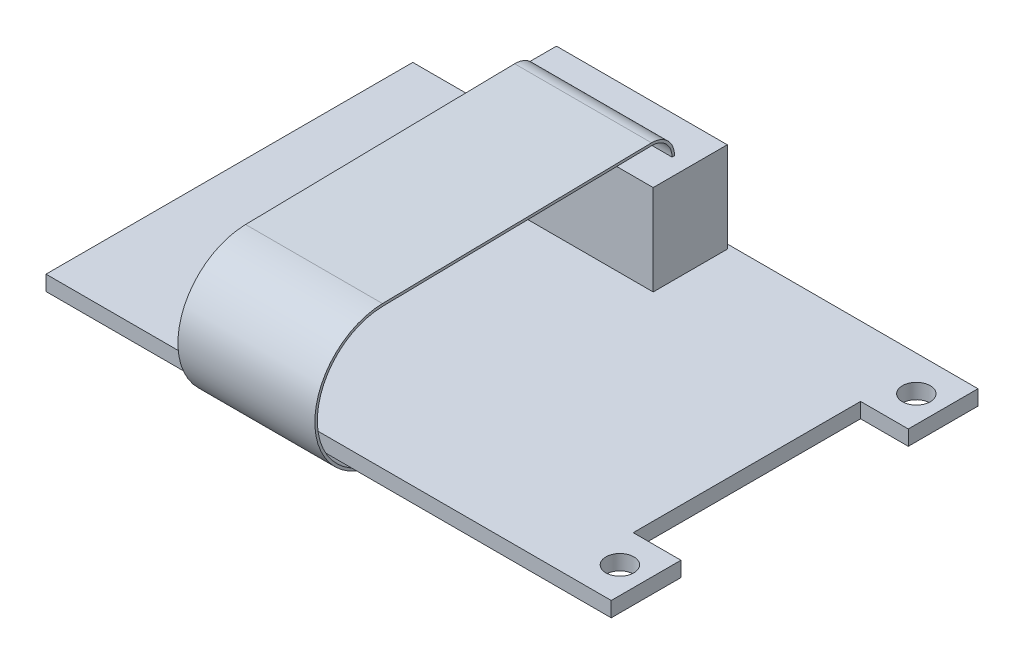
ISO-10303-21;
HEADER;
FILE_DESCRIPTION(('STEP AP214'),'2;1');
FILE_NAME('part.step','',(''),(''),'','','');
FILE_SCHEMA(('AUTOMOTIVE_DESIGN { 1 0 10303 214 1 1 1 1 }'));
ENDSEC;
DATA;
#1=APPLICATION_CONTEXT('core data for automotive mechanical design processes');
#2=APPLICATION_PROTOCOL_DEFINITION('international standard','automotive_design',2000,#1);
#3=PRODUCT_CONTEXT('',#1,'mechanical');
#4=PRODUCT('Part','Part','',(#3));
#5=PRODUCT_RELATED_PRODUCT_CATEGORY('part','',(#4));
#6=PRODUCT_DEFINITION_FORMATION('','',#4);
#7=PRODUCT_DEFINITION_CONTEXT('part definition',#1,'design');
#8=PRODUCT_DEFINITION('design','',#6,#7);
#9=PRODUCT_DEFINITION_SHAPE('','',#8);
#10=(LENGTH_UNIT() NAMED_UNIT(*) SI_UNIT(.MILLI.,.METRE.));
#11=(NAMED_UNIT(*) PLANE_ANGLE_UNIT() SI_UNIT($,.RADIAN.));
#12=(NAMED_UNIT(*) SI_UNIT($,.STERADIAN.) SOLID_ANGLE_UNIT());
#13=UNCERTAINTY_MEASURE_WITH_UNIT(LENGTH_MEASURE(1.E-05),#10,'distance_accuracy_value','');
#14=(GEOMETRIC_REPRESENTATION_CONTEXT(3) GLOBAL_UNCERTAINTY_ASSIGNED_CONTEXT((#13)) GLOBAL_UNIT_ASSIGNED_CONTEXT((#10,
#11,#12)) REPRESENTATION_CONTEXT('',''));
#15=CARTESIAN_POINT('',(0.,0.,0.));
#16=DIRECTION('',(0.,0.,1.));
#17=DIRECTION('',(1.,0.,0.));
#18=AXIS2_PLACEMENT_3D('',#15,#16,#17);
#19=CARTESIAN_POINT('',(-57.15,1.52399999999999,18.542));
#20=DIRECTION('',(0.,1.,0.));
#21=DIRECTION('',(0.,0.,1.));
#22=AXIS2_PLACEMENT_3D('',#19,#20,#21);
#23=PLANE('',#22);
#24=CARTESIAN_POINT('',(-2.6797,1.524,14.986));
#25=DIRECTION('',(0.,1.,0.));
#26=DIRECTION('',(0.,0.,1.));
#27=AXIS2_PLACEMENT_3D('',#24,#25,#26);
#28=CIRCLE('',#27,1.4097);
#29=CARTESIAN_POINT('',(-2.6797,1.524,13.5763));
#30=VERTEX_POINT('',#29);
#31=EDGE_CURVE('E308',#30,#30,#28,.T.);
#32=ORIENTED_EDGE('',*,*,#31,.F.);
#33=EDGE_LOOP('',(#32));
#34=FACE_BOUND('',#33,.T.);
#35=DIRECTION('',(0.,0.,1.));
#36=VECTOR('',#35,1.);
#37=CARTESIAN_POINT('',(-57.15,1.52399999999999,-18.542));
#38=LINE('',#37,#36);
#39=CARTESIAN_POINT('',(-57.15,1.52399999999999,-18.542));
#40=VERTEX_POINT('',#39);
#41=CARTESIAN_POINT('',(-57.15,1.52399999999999,18.542));
#42=VERTEX_POINT('',#41);
#43=EDGE_CURVE('E320',#40,#42,#38,.T.);
#44=ORIENTED_EDGE('',*,*,#43,.T.);
#45=DIRECTION('',(1.,0.,0.));
#46=VECTOR('',#45,1.);
#47=CARTESIAN_POINT('',(-57.15,1.52399999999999,18.542));
#48=LINE('',#47,#46);
#49=CARTESIAN_POINT('',(0.,1.524,18.542));
#50=VERTEX_POINT('',#49);
#51=EDGE_CURVE('E323',#42,#50,#48,.T.);
#52=ORIENTED_EDGE('',*,*,#51,.T.);
#53=DIRECTION('',(0.,0.,-1.));
#54=VECTOR('',#53,1.);
#55=CARTESIAN_POINT('',(0.,1.524,11.4935));
#56=LINE('',#55,#54);
#57=CARTESIAN_POINT('',(0.,1.524,11.4935));
#58=VERTEX_POINT('',#57);
#59=EDGE_CURVE('E326',#50,#58,#56,.T.);
#60=ORIENTED_EDGE('',*,*,#59,.T.);
#61=DIRECTION('',(-1.,0.,0.));
#62=VECTOR('',#61,1.);
#63=CARTESIAN_POINT('',(0.,1.524,11.4935));
#64=LINE('',#63,#62);
#65=CARTESIAN_POINT('',(-4.826,1.524,11.4935));
#66=VERTEX_POINT('',#65);
#67=EDGE_CURVE('E328',#58,#66,#64,.T.);
#68=ORIENTED_EDGE('',*,*,#67,.T.);
#69=DIRECTION('',(0.,0.,-1.));
#70=VECTOR('',#69,1.);
#71=CARTESIAN_POINT('',(-4.826,1.524,-11.4935));
#72=LINE('',#71,#70);
#73=CARTESIAN_POINT('',(-4.826,1.524,-11.4935));
#74=VERTEX_POINT('',#73);
#75=EDGE_CURVE('E330',#66,#74,#72,.T.);
#76=ORIENTED_EDGE('',*,*,#75,.T.);
#77=DIRECTION('',(1.,0.,0.));
#78=VECTOR('',#77,1.);
#79=CARTESIAN_POINT('',(0.,1.524,-11.4935));
#80=LINE('',#79,#78);
#81=CARTESIAN_POINT('',(0.,1.524,-11.4935));
#82=VERTEX_POINT('',#81);
#83=EDGE_CURVE('E332',#74,#82,#80,.T.);
#84=ORIENTED_EDGE('',*,*,#83,.T.);
#85=DIRECTION('',(0.,0.,-1.));
#86=VECTOR('',#85,1.);
#87=CARTESIAN_POINT('',(0.,1.524,-18.542));
#88=LINE('',#87,#86);
#89=CARTESIAN_POINT('',(0.,1.524,-18.542));
#90=VERTEX_POINT('',#89);
#91=EDGE_CURVE('E334',#82,#90,#88,.T.);
#92=ORIENTED_EDGE('',*,*,#91,.T.);
#93=DIRECTION('',(-1.,0.,0.));
#94=VECTOR('',#93,1.);
#95=CARTESIAN_POINT('',(-57.15,1.52399999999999,-18.542));
#96=LINE('',#95,#94);
#97=EDGE_CURVE('E336',#90,#40,#96,.T.);
#98=ORIENTED_EDGE('',*,*,#97,.T.);
#99=EDGE_LOOP('',(#44,#52,#60,#68,#76,#84,#92,#98));
#100=FACE_BOUND('',#99,.T.);
#101=CARTESIAN_POINT('',(-2.6797,1.524,-14.986));
#102=DIRECTION('',(0.,1.,0.));
#103=DIRECTION('',(0.,0.,1.));
#104=AXIS2_PLACEMENT_3D('',#101,#102,#103);
#105=CIRCLE('',#104,1.4097);
#106=CARTESIAN_POINT('',(-2.6797,1.524,-16.3957));
#107=VERTEX_POINT('',#106);
#108=EDGE_CURVE('E314',#107,#107,#105,.T.);
#109=ORIENTED_EDGE('',*,*,#108,.F.);
#110=EDGE_LOOP('',(#109));
#111=FACE_BOUND('',#110,.T.);
#112=DIRECTION('',(1.,0.,0.));
#113=VECTOR('',#112,1.);
#114=CARTESIAN_POINT('',(-42.164,1.52399999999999,-10.5918));
#115=LINE('',#114,#113);
#116=CARTESIAN_POINT('',(-42.164,1.52399999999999,-10.5918));
#117=VERTEX_POINT('',#116);
#118=CARTESIAN_POINT('',(-24.892,1.52399999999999,-10.5918));
#119=VERTEX_POINT('',#118);
#120=EDGE_CURVE('E292',#117,#119,#115,.T.);
#121=ORIENTED_EDGE('',*,*,#120,.F.);
#122=DIRECTION('',(0.,0.,1.));
#123=VECTOR('',#122,1.);
#124=CARTESIAN_POINT('',(-42.164,1.52399999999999,-18.0848));
#125=LINE('',#124,#123);
#126=CARTESIAN_POINT('',(-42.164,1.52399999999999,-18.0848));
#127=VERTEX_POINT('',#126);
#128=EDGE_CURVE('E278',#127,#117,#125,.T.);
#129=ORIENTED_EDGE('',*,*,#128,.F.);
#130=DIRECTION('',(-1.,0.,0.));
#131=VECTOR('',#130,1.);
#132=CARTESIAN_POINT('',(-42.164,1.52399999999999,-18.0848));
#133=LINE('',#132,#131);
#134=CARTESIAN_POINT('',(-24.892,1.52399999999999,-18.0848));
#135=VERTEX_POINT('',#134);
#136=EDGE_CURVE('E283',#135,#127,#133,.T.);
#137=ORIENTED_EDGE('',*,*,#136,.F.);
#138=DIRECTION('',(0.,0.,-1.));
#139=VECTOR('',#138,1.);
#140=CARTESIAN_POINT('',(-24.892,1.52399999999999,-18.0848));
#141=LINE('',#140,#139);
#142=EDGE_CURVE('E294',#119,#135,#141,.T.);
#143=ORIENTED_EDGE('',*,*,#142,.F.);
#144=EDGE_LOOP('',(#121,#129,#137,#143));
#145=FACE_BOUND('',#144,.T.);
#146=ADVANCED_FACE('F38',(#34,#100,#111,#145),#23,.T.);
#147=CARTESIAN_POINT('',(-57.15,0.,18.542));
#148=DIRECTION('',(0.,1.,0.));
#149=DIRECTION('',(0.,0.,1.));
#150=AXIS2_PLACEMENT_3D('',#147,#148,#149);
#151=PLANE('',#150);
#152=CARTESIAN_POINT('',(-2.6797,0.,-14.986));
#153=DIRECTION('',(0.,1.,0.));
#154=DIRECTION('',(0.,0.,1.));
#155=AXIS2_PLACEMENT_3D('',#152,#153,#154);
#156=CIRCLE('',#155,1.4097);
#157=CARTESIAN_POINT('',(-2.6797,0.,-16.3957));
#158=VERTEX_POINT('',#157);
#159=EDGE_CURVE('E311',#158,#158,#156,.T.);
#160=ORIENTED_EDGE('',*,*,#159,.T.);
#161=EDGE_LOOP('',(#160));
#162=FACE_BOUND('',#161,.T.);
#163=DIRECTION('',(0.,0.,1.));
#164=VECTOR('',#163,1.);
#165=CARTESIAN_POINT('',(-57.15,0.,-18.542));
#166=LINE('',#165,#164);
#167=CARTESIAN_POINT('',(-57.15,0.,-18.542));
#168=VERTEX_POINT('',#167);
#169=CARTESIAN_POINT('',(-57.15,0.,18.542));
#170=VERTEX_POINT('',#169);
#171=EDGE_CURVE('E317',#168,#170,#166,.T.);
#172=ORIENTED_EDGE('',*,*,#171,.F.);
#173=DIRECTION('',(-1.,0.,0.));
#174=VECTOR('',#173,1.);
#175=CARTESIAN_POINT('',(-57.15,0.,-18.542));
#176=LINE('',#175,#174);
#177=CARTESIAN_POINT('',(0.,0.,-18.542));
#178=VERTEX_POINT('',#177);
#179=EDGE_CURVE('E324',#178,#168,#176,.T.);
#180=ORIENTED_EDGE('',*,*,#179,.F.);
#181=DIRECTION('',(0.,0.,-1.));
#182=VECTOR('',#181,1.);
#183=CARTESIAN_POINT('',(0.,0.,-18.542));
#184=LINE('',#183,#182);
#185=CARTESIAN_POINT('',(0.,0.,-11.4935));
#186=VERTEX_POINT('',#185);
#187=EDGE_CURVE('E351',#186,#178,#184,.T.);
#188=ORIENTED_EDGE('',*,*,#187,.F.);
#189=DIRECTION('',(1.,0.,0.));
#190=VECTOR('',#189,1.);
#191=CARTESIAN_POINT('',(0.,0.,-11.4935));
#192=LINE('',#191,#190);
#193=CARTESIAN_POINT('',(-4.826,0.,-11.4935));
#194=VERTEX_POINT('',#193);
#195=EDGE_CURVE('E349',#194,#186,#192,.T.);
#196=ORIENTED_EDGE('',*,*,#195,.F.);
#197=DIRECTION('',(0.,0.,-1.));
#198=VECTOR('',#197,1.);
#199=CARTESIAN_POINT('',(-4.826,0.,-11.4935));
#200=LINE('',#199,#198);
#201=CARTESIAN_POINT('',(-4.826,0.,11.4935));
#202=VERTEX_POINT('',#201);
#203=EDGE_CURVE('E347',#202,#194,#200,.T.);
#204=ORIENTED_EDGE('',*,*,#203,.F.);
#205=DIRECTION('',(-1.,0.,0.));
#206=VECTOR('',#205,1.);
#207=CARTESIAN_POINT('',(0.,0.,11.4935));
#208=LINE('',#207,#206);
#209=CARTESIAN_POINT('',(0.,0.,11.4935));
#210=VERTEX_POINT('',#209);
#211=EDGE_CURVE('E345',#210,#202,#208,.T.);
#212=ORIENTED_EDGE('',*,*,#211,.F.);
#213=DIRECTION('',(0.,0.,-1.));
#214=VECTOR('',#213,1.);
#215=CARTESIAN_POINT('',(0.,0.,11.4935));
#216=LINE('',#215,#214);
#217=CARTESIAN_POINT('',(0.,0.,18.542));
#218=VERTEX_POINT('',#217);
#219=EDGE_CURVE('E343',#218,#210,#216,.T.);
#220=ORIENTED_EDGE('',*,*,#219,.F.);
#221=DIRECTION('',(1.,0.,0.));
#222=VECTOR('',#221,1.);
#223=CARTESIAN_POINT('',(-57.15,0.,18.542));
#224=LINE('',#223,#222);
#225=EDGE_CURVE('E341',#170,#218,#224,.T.);
#226=ORIENTED_EDGE('',*,*,#225,.F.);
#227=EDGE_LOOP('',(#172,#180,#188,#196,#204,#212,#220,#226));
#228=FACE_BOUND('',#227,.T.);
#229=CARTESIAN_POINT('',(-2.6797,0.,14.986));
#230=DIRECTION('',(0.,1.,0.));
#231=DIRECTION('',(0.,0.,1.));
#232=AXIS2_PLACEMENT_3D('',#229,#230,#231);
#233=CIRCLE('',#232,1.4097);
#234=CARTESIAN_POINT('',(-2.6797,0.,13.5763));
#235=VERTEX_POINT('',#234);
#236=EDGE_CURVE('E307',#235,#235,#233,.T.);
#237=ORIENTED_EDGE('',*,*,#236,.T.);
#238=EDGE_LOOP('',(#237));
#239=FACE_BOUND('',#238,.T.);
#240=ADVANCED_FACE('F381',(#162,#228,#239),#151,.F.);
#241=CARTESIAN_POINT('',(-57.15,1.52399999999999,-18.542));
#242=DIRECTION('',(1.,0.,0.));
#243=DIRECTION('',(0.,0.,-1.));
#244=AXIS2_PLACEMENT_3D('',#241,#242,#243);
#245=PLANE('',#244);
#246=ORIENTED_EDGE('',*,*,#171,.T.);
#247=DIRECTION('',(0.,-1.,0.));
#248=VECTOR('',#247,1.);
#249=CARTESIAN_POINT('',(-57.15,1.52399999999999,18.542));
#250=LINE('',#249,#248);
#251=EDGE_CURVE('E11',#42,#170,#250,.T.);
#252=ORIENTED_EDGE('',*,*,#251,.F.);
#253=ORIENTED_EDGE('',*,*,#43,.F.);
#254=DIRECTION('',(0.,-1.,0.));
#255=VECTOR('',#254,1.);
#256=CARTESIAN_POINT('',(-57.15,1.52399999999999,-18.542));
#257=LINE('',#256,#255);
#258=EDGE_CURVE('E338',#40,#168,#257,.T.);
#259=ORIENTED_EDGE('',*,*,#258,.T.);
#260=EDGE_LOOP('',(#246,#252,#253,#259));
#261=FACE_BOUND('',#260,.T.);
#262=ADVANCED_FACE('F40',(#261),#245,.F.);
#263=CARTESIAN_POINT('',(-57.15,1.52399999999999,18.542));
#264=DIRECTION('',(0.,0.,-1.));
#265=DIRECTION('',(-1.,0.,0.));
#266=AXIS2_PLACEMENT_3D('',#263,#264,#265);
#267=PLANE('',#266);
#268=ORIENTED_EDGE('',*,*,#225,.T.);
#269=DIRECTION('',(0.,-1.,0.));
#270=VECTOR('',#269,1.);
#271=CARTESIAN_POINT('',(0.,1.524,18.542));
#272=LINE('',#271,#270);
#273=EDGE_CURVE('E46',#50,#218,#272,.T.);
#274=ORIENTED_EDGE('',*,*,#273,.F.);
#275=ORIENTED_EDGE('',*,*,#51,.F.);
#276=ORIENTED_EDGE('',*,*,#251,.T.);
#277=EDGE_LOOP('',(#268,#274,#275,#276));
#278=FACE_BOUND('',#277,.T.);
#279=ADVANCED_FACE('F399',(#278),#267,.F.);
#280=CARTESIAN_POINT('',(0.,1.524,11.4935));
#281=DIRECTION('',(-1.,0.,0.));
#282=DIRECTION('',(0.,0.,1.));
#283=AXIS2_PLACEMENT_3D('',#280,#281,#282);
#284=PLANE('',#283);
#285=ORIENTED_EDGE('',*,*,#219,.T.);
#286=DIRECTION('',(0.,-1.,0.));
#287=VECTOR('',#286,1.);
#288=CARTESIAN_POINT('',(0.,1.524,11.4935));
#289=LINE('',#288,#287);
#290=EDGE_CURVE('E368',#58,#210,#289,.T.);
#291=ORIENTED_EDGE('',*,*,#290,.F.);
#292=ORIENTED_EDGE('',*,*,#59,.F.);
#293=ORIENTED_EDGE('',*,*,#273,.T.);
#294=EDGE_LOOP('',(#285,#291,#292,#293));
#295=FACE_BOUND('',#294,.T.);
#296=ADVANCED_FACE('F375',(#295),#284,.F.);
#297=CARTESIAN_POINT('',(0.,1.524,11.4935));
#298=DIRECTION('',(0.,0.,1.));
#299=DIRECTION('',(1.,0.,0.));
#300=AXIS2_PLACEMENT_3D('',#297,#298,#299);
#301=PLANE('',#300);
#302=ORIENTED_EDGE('',*,*,#211,.T.);
#303=DIRECTION('',(0.,-1.,0.));
#304=VECTOR('',#303,1.);
#305=CARTESIAN_POINT('',(-4.826,1.524,11.4935));
#306=LINE('',#305,#304);
#307=EDGE_CURVE('E365',#66,#202,#306,.T.);
#308=ORIENTED_EDGE('',*,*,#307,.F.);
#309=ORIENTED_EDGE('',*,*,#67,.F.);
#310=ORIENTED_EDGE('',*,*,#290,.T.);
#311=EDGE_LOOP('',(#302,#308,#309,#310));
#312=FACE_BOUND('',#311,.T.);
#313=ADVANCED_FACE('F387',(#312),#301,.F.);
#314=CARTESIAN_POINT('',(-4.826,1.524,-11.4935));
#315=DIRECTION('',(-1.,0.,0.));
#316=DIRECTION('',(0.,0.,1.));
#317=AXIS2_PLACEMENT_3D('',#314,#315,#316);
#318=PLANE('',#317);
#319=ORIENTED_EDGE('',*,*,#203,.T.);
#320=DIRECTION('',(0.,-1.,0.));
#321=VECTOR('',#320,1.);
#322=CARTESIAN_POINT('',(-4.826,1.524,-11.4935));
#323=LINE('',#322,#321);
#324=EDGE_CURVE('E362',#74,#194,#323,.T.);
#325=ORIENTED_EDGE('',*,*,#324,.F.);
#326=ORIENTED_EDGE('',*,*,#75,.F.);
#327=ORIENTED_EDGE('',*,*,#307,.T.);
#328=EDGE_LOOP('',(#319,#325,#326,#327));
#329=FACE_BOUND('',#328,.T.);
#330=ADVANCED_FACE('F391',(#329),#318,.F.);
#331=CARTESIAN_POINT('',(0.,1.524,-11.4935));
#332=DIRECTION('',(0.,0.,-1.));
#333=DIRECTION('',(-1.,0.,0.));
#334=AXIS2_PLACEMENT_3D('',#331,#332,#333);
#335=PLANE('',#334);
#336=ORIENTED_EDGE('',*,*,#195,.T.);
#337=DIRECTION('',(0.,-1.,0.));
#338=VECTOR('',#337,1.);
#339=CARTESIAN_POINT('',(0.,1.524,-11.4935));
#340=LINE('',#339,#338);
#341=EDGE_CURVE('E359',#82,#186,#340,.T.);
#342=ORIENTED_EDGE('',*,*,#341,.F.);
#343=ORIENTED_EDGE('',*,*,#83,.F.);
#344=ORIENTED_EDGE('',*,*,#324,.T.);
#345=EDGE_LOOP('',(#336,#342,#343,#344));
#346=FACE_BOUND('',#345,.T.);
#347=ADVANCED_FACE('F412',(#346),#335,.F.);
#348=CARTESIAN_POINT('',(0.,1.524,-18.542));
#349=DIRECTION('',(-1.,0.,0.));
#350=DIRECTION('',(0.,0.,1.));
#351=AXIS2_PLACEMENT_3D('',#348,#349,#350);
#352=PLANE('',#351);
#353=ORIENTED_EDGE('',*,*,#187,.T.);
#354=DIRECTION('',(0.,-1.,0.));
#355=VECTOR('',#354,1.);
#356=CARTESIAN_POINT('',(0.,1.524,-18.542));
#357=LINE('',#356,#355);
#358=EDGE_CURVE('E356',#90,#178,#357,.T.);
#359=ORIENTED_EDGE('',*,*,#358,.F.);
#360=ORIENTED_EDGE('',*,*,#91,.F.);
#361=ORIENTED_EDGE('',*,*,#341,.T.);
#362=EDGE_LOOP('',(#353,#359,#360,#361));
#363=FACE_BOUND('',#362,.T.);
#364=ADVANCED_FACE('F410',(#363),#352,.F.);
#365=CARTESIAN_POINT('',(-57.15,1.52399999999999,-18.542));
#366=DIRECTION('',(0.,0.,1.));
#367=DIRECTION('',(1.,0.,0.));
#368=AXIS2_PLACEMENT_3D('',#365,#366,#367);
#369=PLANE('',#368);
#370=ORIENTED_EDGE('',*,*,#179,.T.);
#371=ORIENTED_EDGE('',*,*,#258,.F.);
#372=ORIENTED_EDGE('',*,*,#97,.F.);
#373=ORIENTED_EDGE('',*,*,#358,.T.);
#374=EDGE_LOOP('',(#370,#371,#372,#373));
#375=FACE_BOUND('',#374,.T.);
#376=ADVANCED_FACE('F405',(#375),#369,.F.);
#377=CARTESIAN_POINT('',(-2.6797,1.524,-14.986));
#378=DIRECTION('',(0.,-1.,0.));
#379=DIRECTION('',(0.,0.,-1.));
#380=AXIS2_PLACEMENT_3D('',#377,#378,#379);
#381=CYLINDRICAL_SURFACE('',#380,1.4097);
#382=CARTESIAN_POINT('',(-2.6797,1.524,-16.3957));
#383=CARTESIAN_POINT('',(-2.6797,1.508125,-16.3957));
#384=CARTESIAN_POINT('',(-2.6797,1.49225,-16.3957));
#385=CARTESIAN_POINT('',(-2.6797,1.4605,-16.3957));
#386=CARTESIAN_POINT('',(-2.6797,1.444625,-16.3957));
#387=CARTESIAN_POINT('',(-2.6797,1.412875,-16.3957));
#388=CARTESIAN_POINT('',(-2.6797,1.397,-16.3957));
#389=CARTESIAN_POINT('',(-2.6797,1.36525,-16.3957));
#390=CARTESIAN_POINT('',(-2.6797,1.349375,-16.3957));
#391=CARTESIAN_POINT('',(-2.6797,1.317625,-16.3957));
#392=CARTESIAN_POINT('',(-2.6797,1.30175,-16.3957));
#393=CARTESIAN_POINT('',(-2.6797,1.27,-16.3957));
#394=CARTESIAN_POINT('',(-2.6797,1.254125,-16.3957));
#395=CARTESIAN_POINT('',(-2.6797,1.222375,-16.3957));
#396=CARTESIAN_POINT('',(-2.6797,1.2065,-16.3957));
#397=CARTESIAN_POINT('',(-2.6797,1.17475,-16.3957));
#398=CARTESIAN_POINT('',(-2.6797,1.158875,-16.3957));
#399=CARTESIAN_POINT('',(-2.6797,1.127125,-16.3957));
#400=CARTESIAN_POINT('',(-2.6797,1.11125,-16.3957));
#401=CARTESIAN_POINT('',(-2.6797,1.0795,-16.3957));
#402=CARTESIAN_POINT('',(-2.6797,1.063625,-16.3957));
#403=CARTESIAN_POINT('',(-2.6797,1.031875,-16.3957));
#404=CARTESIAN_POINT('',(-2.6797,1.016,-16.3957));
#405=CARTESIAN_POINT('',(-2.6797,0.984249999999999,-16.3957));
#406=CARTESIAN_POINT('',(-2.6797,0.968374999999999,-16.3957));
#407=CARTESIAN_POINT('',(-2.6797,0.936624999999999,-16.3957));
#408=CARTESIAN_POINT('',(-2.6797,0.920749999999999,-16.3957));
#409=CARTESIAN_POINT('',(-2.6797,0.888999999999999,-16.3957));
#410=CARTESIAN_POINT('',(-2.6797,0.873124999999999,-16.3957));
#411=CARTESIAN_POINT('',(-2.6797,0.841374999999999,-16.3957));
#412=CARTESIAN_POINT('',(-2.6797,0.825499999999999,-16.3957));
#413=CARTESIAN_POINT('',(-2.6797,0.793749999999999,-16.3957));
#414=CARTESIAN_POINT('',(-2.6797,0.777874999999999,-16.3957));
#415=CARTESIAN_POINT('',(-2.6797,0.746124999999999,-16.3957));
#416=CARTESIAN_POINT('',(-2.6797,0.730249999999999,-16.3957));
#417=CARTESIAN_POINT('',(-2.6797,0.698499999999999,-16.3957));
#418=CARTESIAN_POINT('',(-2.6797,0.682624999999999,-16.3957));
#419=CARTESIAN_POINT('',(-2.6797,0.650874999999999,-16.3957));
#420=CARTESIAN_POINT('',(-2.6797,0.634999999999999,-16.3957));
#421=CARTESIAN_POINT('',(-2.6797,0.603249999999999,-16.3957));
#422=CARTESIAN_POINT('',(-2.6797,0.587374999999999,-16.3957));
#423=CARTESIAN_POINT('',(-2.6797,0.555624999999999,-16.3957));
#424=CARTESIAN_POINT('',(-2.6797,0.539749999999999,-16.3957));
#425=CARTESIAN_POINT('',(-2.6797,0.507999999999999,-16.3957));
#426=CARTESIAN_POINT('',(-2.6797,0.492124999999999,-16.3957));
#427=CARTESIAN_POINT('',(-2.6797,0.460374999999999,-16.3957));
#428=CARTESIAN_POINT('',(-2.6797,0.4445,-16.3957));
#429=CARTESIAN_POINT('',(-2.6797,0.41275,-16.3957));
#430=CARTESIAN_POINT('',(-2.6797,0.396875,-16.3957));
#431=CARTESIAN_POINT('',(-2.6797,0.365125,-16.3957));
#432=CARTESIAN_POINT('',(-2.6797,0.34925,-16.3957));
#433=CARTESIAN_POINT('',(-2.6797,0.3175,-16.3957));
#434=CARTESIAN_POINT('',(-2.6797,0.301625,-16.3957));
#435=CARTESIAN_POINT('',(-2.6797,0.269875,-16.3957));
#436=CARTESIAN_POINT('',(-2.6797,0.254,-16.3957));
#437=CARTESIAN_POINT('',(-2.6797,0.22225,-16.3957));
#438=CARTESIAN_POINT('',(-2.6797,0.206375,-16.3957));
#439=CARTESIAN_POINT('',(-2.6797,0.174625,-16.3957));
#440=CARTESIAN_POINT('',(-2.6797,0.15875,-16.3957));
#441=CARTESIAN_POINT('',(-2.6797,0.127,-16.3957));
#442=CARTESIAN_POINT('',(-2.6797,0.111125,-16.3957));
#443=CARTESIAN_POINT('',(-2.6797,0.0793750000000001,-16.3957));
#444=CARTESIAN_POINT('',(-2.6797,0.0635000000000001,-16.3957));
#445=CARTESIAN_POINT('',(-2.6797,0.0317500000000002,-16.3957));
#446=CARTESIAN_POINT('',(-2.6797,0.0158750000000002,-16.3957));
#447=CARTESIAN_POINT('',(-2.6797,0.,-16.3957));
#448=B_SPLINE_CURVE_WITH_KNOTS('',3,(#382,#383,#384,#385,#386,#387,#388,#389,#390,#391,#392,
#393,#394,#395,#396,#397,#398,#399,#400,#401,#402,#403,#404,#405,#406,#407,#408,#409,#410,#411,
#412,#413,#414,#415,#416,#417,#418,#419,#420,#421,#422,#423,#424,#425,#426,#427,#428,#429,#430,
#431,#432,#433,#434,#435,#436,#437,#438,#439,#440,#441,#442,#443,#444,#445,#446,#447),
.UNSPECIFIED.,.F.,.F.,(4,2,2,2,2,2,2,2,2,2,2,2,2,2,2,2,2,2,2,2,2,2,2,2,2,2,2,2,2,2,2,2,4),(0.,
0.0476249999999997,0.0952499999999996,0.142875,0.190499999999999,0.238124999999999,
0.285749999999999,0.333374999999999,0.380999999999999,0.428624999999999,0.476249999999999,
0.523874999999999,0.571499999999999,0.619124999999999,0.666749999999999,0.714374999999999,
0.761999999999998,0.809624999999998,0.857249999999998,0.904874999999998,0.952499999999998,
1.000125,1.04775,1.095375,1.143,1.190625,1.23825,1.285875,1.3335,1.381125,1.42875,1.476375,
1.524),.UNSPECIFIED.);
#449=EDGE_CURVE('BSEAM431',#107,#158,#448,.T.);
#450=ORIENTED_EDGE('',*,*,#108,.T.);
#451=ORIENTED_EDGE('',*,*,#159,.F.);
#452=ORIENTED_EDGE('',*,*,#449,.T.);
#453=ORIENTED_EDGE('',*,*,#449,.F.);
#454=EDGE_LOOP('',(#450,#452,#451,#453));
#455=FACE_BOUND('',#454,.T.);
#456=ADVANCED_FACE('F431',(#455),#381,.F.);
#457=CARTESIAN_POINT('',(-2.6797,1.524,14.986));
#458=DIRECTION('',(0.,-1.,0.));
#459=DIRECTION('',(0.,0.,-1.));
#460=AXIS2_PLACEMENT_3D('',#457,#458,#459);
#461=CYLINDRICAL_SURFACE('',#460,1.4097);
#462=CARTESIAN_POINT('',(-2.6797,1.524,13.5763));
#463=CARTESIAN_POINT('',(-2.6797,1.508125,13.5763));
#464=CARTESIAN_POINT('',(-2.6797,1.49225,13.5763));
#465=CARTESIAN_POINT('',(-2.6797,1.4605,13.5763));
#466=CARTESIAN_POINT('',(-2.6797,1.444625,13.5763));
#467=CARTESIAN_POINT('',(-2.6797,1.412875,13.5763));
#468=CARTESIAN_POINT('',(-2.6797,1.397,13.5763));
#469=CARTESIAN_POINT('',(-2.6797,1.36525,13.5763));
#470=CARTESIAN_POINT('',(-2.6797,1.349375,13.5763));
#471=CARTESIAN_POINT('',(-2.6797,1.317625,13.5763));
#472=CARTESIAN_POINT('',(-2.6797,1.30175,13.5763));
#473=CARTESIAN_POINT('',(-2.6797,1.27,13.5763));
#474=CARTESIAN_POINT('',(-2.6797,1.254125,13.5763));
#475=CARTESIAN_POINT('',(-2.6797,1.222375,13.5763));
#476=CARTESIAN_POINT('',(-2.6797,1.2065,13.5763));
#477=CARTESIAN_POINT('',(-2.6797,1.17475,13.5763));
#478=CARTESIAN_POINT('',(-2.6797,1.158875,13.5763));
#479=CARTESIAN_POINT('',(-2.6797,1.127125,13.5763));
#480=CARTESIAN_POINT('',(-2.6797,1.11125,13.5763));
#481=CARTESIAN_POINT('',(-2.6797,1.0795,13.5763));
#482=CARTESIAN_POINT('',(-2.6797,1.063625,13.5763));
#483=CARTESIAN_POINT('',(-2.6797,1.031875,13.5763));
#484=CARTESIAN_POINT('',(-2.6797,1.016,13.5763));
#485=CARTESIAN_POINT('',(-2.6797,0.984249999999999,13.5763));
#486=CARTESIAN_POINT('',(-2.6797,0.968374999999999,13.5763));
#487=CARTESIAN_POINT('',(-2.6797,0.936624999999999,13.5763));
#488=CARTESIAN_POINT('',(-2.6797,0.920749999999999,13.5763));
#489=CARTESIAN_POINT('',(-2.6797,0.888999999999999,13.5763));
#490=CARTESIAN_POINT('',(-2.6797,0.873124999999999,13.5763));
#491=CARTESIAN_POINT('',(-2.6797,0.841374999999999,13.5763));
#492=CARTESIAN_POINT('',(-2.6797,0.825499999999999,13.5763));
#493=CARTESIAN_POINT('',(-2.6797,0.793749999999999,13.5763));
#494=CARTESIAN_POINT('',(-2.6797,0.777874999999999,13.5763));
#495=CARTESIAN_POINT('',(-2.6797,0.746124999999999,13.5763));
#496=CARTESIAN_POINT('',(-2.6797,0.730249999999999,13.5763));
#497=CARTESIAN_POINT('',(-2.6797,0.698499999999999,13.5763));
#498=CARTESIAN_POINT('',(-2.6797,0.682624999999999,13.5763));
#499=CARTESIAN_POINT('',(-2.6797,0.650874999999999,13.5763));
#500=CARTESIAN_POINT('',(-2.6797,0.634999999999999,13.5763));
#501=CARTESIAN_POINT('',(-2.6797,0.603249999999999,13.5763));
#502=CARTESIAN_POINT('',(-2.6797,0.587374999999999,13.5763));
#503=CARTESIAN_POINT('',(-2.6797,0.555624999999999,13.5763));
#504=CARTESIAN_POINT('',(-2.6797,0.539749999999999,13.5763));
#505=CARTESIAN_POINT('',(-2.6797,0.507999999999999,13.5763));
#506=CARTESIAN_POINT('',(-2.6797,0.492124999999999,13.5763));
#507=CARTESIAN_POINT('',(-2.6797,0.460374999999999,13.5763));
#508=CARTESIAN_POINT('',(-2.6797,0.4445,13.5763));
#509=CARTESIAN_POINT('',(-2.6797,0.41275,13.5763));
#510=CARTESIAN_POINT('',(-2.6797,0.396875,13.5763));
#511=CARTESIAN_POINT('',(-2.6797,0.365125,13.5763));
#512=CARTESIAN_POINT('',(-2.6797,0.34925,13.5763));
#513=CARTESIAN_POINT('',(-2.6797,0.3175,13.5763));
#514=CARTESIAN_POINT('',(-2.6797,0.301625,13.5763));
#515=CARTESIAN_POINT('',(-2.6797,0.269875,13.5763));
#516=CARTESIAN_POINT('',(-2.6797,0.254,13.5763));
#517=CARTESIAN_POINT('',(-2.6797,0.22225,13.5763));
#518=CARTESIAN_POINT('',(-2.6797,0.206375,13.5763));
#519=CARTESIAN_POINT('',(-2.6797,0.174625,13.5763));
#520=CARTESIAN_POINT('',(-2.6797,0.15875,13.5763));
#521=CARTESIAN_POINT('',(-2.6797,0.127,13.5763));
#522=CARTESIAN_POINT('',(-2.6797,0.111125,13.5763));
#523=CARTESIAN_POINT('',(-2.6797,0.0793750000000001,13.5763));
#524=CARTESIAN_POINT('',(-2.6797,0.0635000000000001,13.5763));
#525=CARTESIAN_POINT('',(-2.6797,0.0317500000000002,13.5763));
#526=CARTESIAN_POINT('',(-2.6797,0.0158750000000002,13.5763));
#527=CARTESIAN_POINT('',(-2.6797,0.,13.5763));
#528=B_SPLINE_CURVE_WITH_KNOTS('',3,(#462,#463,#464,#465,#466,#467,#468,#469,#470,#471,#472,
#473,#474,#475,#476,#477,#478,#479,#480,#481,#482,#483,#484,#485,#486,#487,#488,#489,#490,#491,
#492,#493,#494,#495,#496,#497,#498,#499,#500,#501,#502,#503,#504,#505,#506,#507,#508,#509,#510,
#511,#512,#513,#514,#515,#516,#517,#518,#519,#520,#521,#522,#523,#524,#525,#526,#527),
.UNSPECIFIED.,.F.,.F.,(4,2,2,2,2,2,2,2,2,2,2,2,2,2,2,2,2,2,2,2,2,2,2,2,2,2,2,2,2,2,2,2,4),(0.,
0.0476249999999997,0.0952499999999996,0.142875,0.190499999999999,0.238124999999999,
0.285749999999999,0.333374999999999,0.380999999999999,0.428624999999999,0.476249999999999,
0.523874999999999,0.571499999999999,0.619124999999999,0.666749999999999,0.714374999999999,
0.761999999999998,0.809624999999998,0.857249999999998,0.904874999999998,0.952499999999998,
1.000125,1.04775,1.095375,1.143,1.190625,1.23825,1.285875,1.3335,1.381125,1.42875,1.476375,
1.524),.UNSPECIFIED.);
#529=EDGE_CURVE('BSEAM438',#30,#235,#528,.T.);
#530=ORIENTED_EDGE('',*,*,#31,.T.);
#531=ORIENTED_EDGE('',*,*,#236,.F.);
#532=ORIENTED_EDGE('',*,*,#529,.T.);
#533=ORIENTED_EDGE('',*,*,#529,.F.);
#534=EDGE_LOOP('',(#530,#532,#531,#533));
#535=FACE_BOUND('',#534,.T.);
#536=ADVANCED_FACE('F438',(#535),#461,.F.);
#537=CARTESIAN_POINT('',(-42.164,10.668,-18.0848));
#538=DIRECTION('',(1.,0.,0.));
#539=DIRECTION('',(0.,0.,-1.));
#540=AXIS2_PLACEMENT_3D('',#537,#538,#539);
#541=PLANE('',#540);
#542=ORIENTED_EDGE('',*,*,#128,.T.);
#543=DIRECTION('',(0.,-1.,0.));
#544=VECTOR('',#543,1.);
#545=CARTESIAN_POINT('',(-42.164,10.668,-10.5918));
#546=LINE('',#545,#544);
#547=CARTESIAN_POINT('',(-42.164,10.668,-10.5918));
#548=VERTEX_POINT('',#547);
#549=EDGE_CURVE('E305',#548,#117,#546,.T.);
#550=ORIENTED_EDGE('',*,*,#549,.F.);
#551=DIRECTION('',(0.,0.,1.));
#552=VECTOR('',#551,1.);
#553=CARTESIAN_POINT('',(-42.164,10.668,-18.0848));
#554=LINE('',#553,#552);
#555=CARTESIAN_POINT('',(-42.164,10.668,-18.0848));
#556=VERTEX_POINT('',#555);
#557=EDGE_CURVE('E279',#556,#548,#554,.T.);
#558=ORIENTED_EDGE('',*,*,#557,.F.);
#559=DIRECTION('',(0.,-1.,0.));
#560=VECTOR('',#559,1.);
#561=CARTESIAN_POINT('',(-42.164,10.668,-18.0848));
#562=LINE('',#561,#560);
#563=EDGE_CURVE('E289',#556,#127,#562,.T.);
#564=ORIENTED_EDGE('',*,*,#563,.T.);
#565=EDGE_LOOP('',(#542,#550,#558,#564));
#566=FACE_BOUND('',#565,.T.);
#567=ADVANCED_FACE('F443',(#566),#541,.F.);
#568=CARTESIAN_POINT('',(-42.164,10.668,-10.5918));
#569=DIRECTION('',(0.,0.,-1.));
#570=DIRECTION('',(-1.,0.,0.));
#571=AXIS2_PLACEMENT_3D('',#568,#569,#570);
#572=PLANE('',#571);
#573=ORIENTED_EDGE('',*,*,#120,.T.);
#574=DIRECTION('',(0.,-1.,0.));
#575=VECTOR('',#574,1.);
#576=CARTESIAN_POINT('',(-24.892,10.668,-10.5918));
#577=LINE('',#576,#575);
#578=CARTESIAN_POINT('',(-24.892,10.668,-10.5918));
#579=VERTEX_POINT('',#578);
#580=EDGE_CURVE('E302',#579,#119,#577,.T.);
#581=ORIENTED_EDGE('',*,*,#580,.F.);
#582=DIRECTION('',(1.,0.,0.));
#583=VECTOR('',#582,1.);
#584=CARTESIAN_POINT('',(-42.164,10.668,-10.5918));
#585=LINE('',#584,#583);
#586=EDGE_CURVE('E282',#548,#579,#585,.T.);
#587=ORIENTED_EDGE('',*,*,#586,.F.);
#588=ORIENTED_EDGE('',*,*,#549,.T.);
#589=EDGE_LOOP('',(#573,#581,#587,#588));
#590=FACE_BOUND('',#589,.T.);
#591=ADVANCED_FACE('F455',(#590),#572,.F.);
#592=CARTESIAN_POINT('',(-24.892,10.668,-18.0848));
#593=DIRECTION('',(-1.,0.,0.));
#594=DIRECTION('',(0.,0.,1.));
#595=AXIS2_PLACEMENT_3D('',#592,#593,#594);
#596=PLANE('',#595);
#597=ORIENTED_EDGE('',*,*,#142,.T.);
#598=DIRECTION('',(0.,-1.,0.));
#599=VECTOR('',#598,1.);
#600=CARTESIAN_POINT('',(-24.892,10.668,-18.0848));
#601=LINE('',#600,#599);
#602=CARTESIAN_POINT('',(-24.892,10.668,-18.0848));
#603=VERTEX_POINT('',#602);
#604=EDGE_CURVE('E300',#603,#135,#601,.T.);
#605=ORIENTED_EDGE('',*,*,#604,.F.);
#606=DIRECTION('',(0.,0.,-1.));
#607=VECTOR('',#606,1.);
#608=CARTESIAN_POINT('',(-24.892,10.668,-18.0848));
#609=LINE('',#608,#607);
#610=EDGE_CURVE('E285',#579,#603,#609,.T.);
#611=ORIENTED_EDGE('',*,*,#610,.F.);
#612=ORIENTED_EDGE('',*,*,#580,.T.);
#613=EDGE_LOOP('',(#597,#605,#611,#612));
#614=FACE_BOUND('',#613,.T.);
#615=ADVANCED_FACE('F459',(#614),#596,.F.);
#616=CARTESIAN_POINT('',(-42.164,10.668,-18.0848));
#617=DIRECTION('',(0.,0.,1.));
#618=DIRECTION('',(1.,0.,0.));
#619=AXIS2_PLACEMENT_3D('',#616,#617,#618);
#620=PLANE('',#619);
#621=ORIENTED_EDGE('',*,*,#136,.T.);
#622=ORIENTED_EDGE('',*,*,#563,.F.);
#623=DIRECTION('',(-1.,0.,0.));
#624=VECTOR('',#623,1.);
#625=CARTESIAN_POINT('',(-42.164,10.668,-18.0848));
#626=LINE('',#625,#624);
#627=EDGE_CURVE('E287',#603,#556,#626,.T.);
#628=ORIENTED_EDGE('',*,*,#627,.F.);
#629=ORIENTED_EDGE('',*,*,#604,.T.);
#630=EDGE_LOOP('',(#621,#622,#628,#629));
#631=FACE_BOUND('',#630,.T.);
#632=ADVANCED_FACE('F466',(#631),#620,.F.);
#633=CARTESIAN_POINT('',(-42.164,10.668,-10.5918));
#634=DIRECTION('',(0.,1.,0.));
#635=DIRECTION('',(0.,0.,1.));
#636=AXIS2_PLACEMENT_3D('',#633,#634,#635);
#637=PLANE('',#636);
#638=DIRECTION('',(0.,0.,-1.));
#639=VECTOR('',#638,1.);
#640=CARTESIAN_POINT('',(-26.6065,10.668,-14.2113));
#641=LINE('',#640,#639);
#642=CARTESIAN_POINT('',(-26.6065,10.668,-14.2113));
#643=VERTEX_POINT('',#642);
#644=CARTESIAN_POINT('',(-26.6065,10.668,-14.4653));
#645=VERTEX_POINT('',#644);
#646=EDGE_CURVE('E58',#643,#645,#641,.T.);
#647=ORIENTED_EDGE('',*,*,#646,.F.);
#648=DIRECTION('',(1.,0.,0.));
#649=VECTOR('',#648,1.);
#650=CARTESIAN_POINT('',(-26.6065,10.668,-14.2113));
#651=LINE('',#650,#649);
#652=CARTESIAN_POINT('',(-40.4495,10.668,-14.2113));
#653=VERTEX_POINT('',#652);
#654=EDGE_CURVE('E189',#653,#643,#651,.T.);
#655=ORIENTED_EDGE('',*,*,#654,.F.);
#656=DIRECTION('',(0.,0.,1.));
#657=VECTOR('',#656,1.);
#658=CARTESIAN_POINT('',(-40.4495,10.668,-14.2113));
#659=LINE('',#658,#657);
#660=CARTESIAN_POINT('',(-40.4495,10.668,-14.4653));
#661=VERTEX_POINT('',#660);
#662=EDGE_CURVE('E184',#661,#653,#659,.T.);
#663=ORIENTED_EDGE('',*,*,#662,.F.);
#664=DIRECTION('',(-1.,0.,0.));
#665=VECTOR('',#664,1.);
#666=CARTESIAN_POINT('',(-26.6065,10.668,-14.4653));
#667=LINE('',#666,#665);
#668=EDGE_CURVE('E53',#645,#661,#667,.T.);
#669=ORIENTED_EDGE('',*,*,#668,.F.);
#670=EDGE_LOOP('',(#647,#655,#663,#669));
#671=FACE_BOUND('',#670,.T.);
#672=ORIENTED_EDGE('',*,*,#557,.T.);
#673=ORIENTED_EDGE('',*,*,#586,.T.);
#674=ORIENTED_EDGE('',*,*,#610,.T.);
#675=ORIENTED_EDGE('',*,*,#627,.T.);
#676=EDGE_LOOP('',(#672,#673,#674,#675));
#677=FACE_BOUND('',#676,.T.);
#678=ADVANCED_FACE('F186',(#671,#677),#637,.T.);
#679=CARTESIAN_POINT('',(-26.6065,-2.49374031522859,17.2367481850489));
#680=DIRECTION('',(-1.,0.,0.));
#681=DIRECTION('',(0.,0.,1.));
#682=AXIS2_PLACEMENT_3D('',#679,#680,#681);
#683=CYLINDRICAL_SURFACE('',#682,1.366309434);
#684=DIRECTION('',(-1.,0.,0.));
#685=VECTOR('',#684,1.);
#686=CARTESIAN_POINT('',(-26.6065,-1.18035939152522,16.8601422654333));
#687=LINE('',#686,#685);
#688=CARTESIAN_POINT('',(-26.6065,-1.18035939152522,16.8601422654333));
#689=VERTEX_POINT('',#688);
#690=CARTESIAN_POINT('',(-40.4495,-1.18035939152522,16.8601422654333));
#691=VERTEX_POINT('',#690);
#692=EDGE_CURVE('E239',#689,#691,#687,.T.);
#693=ORIENTED_EDGE('',*,*,#692,.T.);
#694=CARTESIAN_POINT('',(-40.4495,-2.49374031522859,17.2367481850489));
#695=DIRECTION('',(-1.,0.,0.));
#696=DIRECTION('',(0.,0.,1.));
#697=AXIS2_PLACEMENT_3D('',#694,#695,#696);
#698=CIRCLE('',#697,1.366309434);
#699=CARTESIAN_POINT('',(-40.4495,-2.41227736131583,15.8728694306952));
#700=VERTEX_POINT('',#699);
#701=EDGE_CURVE('E272',#691,#700,#698,.T.);
#702=ORIENTED_EDGE('',*,*,#701,.T.);
#703=DIRECTION('',(-1.,0.,0.));
#704=VECTOR('',#703,1.);
#705=CARTESIAN_POINT('',(-26.6065,-2.41227736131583,15.8728694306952));
#706=LINE('',#705,#704);
#707=CARTESIAN_POINT('',(-26.6065,-2.41227736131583,15.8728694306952));
#708=VERTEX_POINT('',#707);
#709=EDGE_CURVE('E263',#708,#700,#706,.T.);
#710=ORIENTED_EDGE('',*,*,#709,.F.);
#711=CARTESIAN_POINT('',(-26.6065,-2.49374031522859,17.2367481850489));
#712=DIRECTION('',(-1.,0.,0.));
#713=DIRECTION('',(0.,0.,1.));
#714=AXIS2_PLACEMENT_3D('',#711,#712,#713);
#715=CIRCLE('',#714,1.366309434);
#716=EDGE_CURVE('E275',#689,#708,#715,.T.);
#717=ORIENTED_EDGE('',*,*,#716,.F.);
#718=EDGE_LOOP('',(#693,#702,#710,#717));
#719=FACE_BOUND('',#718,.T.);
#720=ADVANCED_FACE('F473',(#719),#683,.F.);
#721=CARTESIAN_POINT('',(-26.6065,-2.49374031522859,17.2367481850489));
#722=DIRECTION('',(-1.,0.,0.));
#723=DIRECTION('',(0.,0.,1.));
#724=AXIS2_PLACEMENT_3D('',#721,#722,#723);
#725=CYLINDRICAL_SURFACE('',#724,1.620309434);
#726=DIRECTION('',(1.,0.,0.));
#727=VECTOR('',#726,1.);
#728=CARTESIAN_POINT('',(-26.6065,-0.93619892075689,16.7901303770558));
#729=LINE('',#728,#727);
#730=CARTESIAN_POINT('',(-40.4495,-0.93619892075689,16.7901303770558));
#731=VERTEX_POINT('',#730);
#732=CARTESIAN_POINT('',(-26.6065,-0.93619892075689,16.7901303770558));
#733=VERTEX_POINT('',#732);
#734=EDGE_CURVE('E236',#731,#733,#729,.T.);
#735=ORIENTED_EDGE('',*,*,#734,.T.);
#736=CARTESIAN_POINT('',(-26.6065,-2.49374031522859,17.2367481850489));
#737=DIRECTION('',(-1.,0.,0.));
#738=DIRECTION('',(0.,0.,1.));
#739=AXIS2_PLACEMENT_3D('',#736,#737,#738);
#740=CIRCLE('',#739,1.620309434);
#741=CARTESIAN_POINT('',(-26.6065,-2.39713321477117,15.6193212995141));
#742=VERTEX_POINT('',#741);
#743=EDGE_CURVE('E266',#733,#742,#740,.T.);
#744=ORIENTED_EDGE('',*,*,#743,.T.);
#745=DIRECTION('',(1.,0.,0.));
#746=VECTOR('',#745,1.);
#747=CARTESIAN_POINT('',(-26.6065,-2.39713321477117,15.6193212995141));
#748=LINE('',#747,#746);
#749=CARTESIAN_POINT('',(-40.4495,-2.39713321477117,15.6193212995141));
#750=VERTEX_POINT('',#749);
#751=EDGE_CURVE('E257',#750,#742,#748,.T.);
#752=ORIENTED_EDGE('',*,*,#751,.F.);
#753=CARTESIAN_POINT('',(-40.4495,-2.49374031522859,17.2367481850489));
#754=DIRECTION('',(-1.,0.,0.));
#755=DIRECTION('',(0.,0.,1.));
#756=AXIS2_PLACEMENT_3D('',#753,#754,#755);
#757=CIRCLE('',#756,1.620309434);
#758=EDGE_CURVE('E269',#731,#750,#757,.T.);
#759=ORIENTED_EDGE('',*,*,#758,.F.);
#760=EDGE_LOOP('',(#735,#744,#752,#759));
#761=FACE_BOUND('',#760,.T.);
#762=ADVANCED_FACE('F512',(#761),#725,.T.);
#763=CARTESIAN_POINT('',(-26.6065,5.5148696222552,14.9403162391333));
#764=DIRECTION('',(1.,0.,0.));
#765=DIRECTION('',(0.,0.,-1.));
#766=AXIS2_PLACEMENT_3D('',#763,#764,#765);
#767=CYLINDRICAL_SURFACE('',#766,6.965042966);
#768=DIRECTION('',(-1.,0.,0.));
#769=VECTOR('',#768,1.);
#770=CARTESIAN_POINT('',(-26.6065,12.4788517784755,15.0618729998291));
#771=LINE('',#770,#769);
#772=CARTESIAN_POINT('',(-26.6065,12.4788517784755,15.0618729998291));
#773=VERTEX_POINT('',#772);
#774=CARTESIAN_POINT('',(-40.4495,12.4788517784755,15.0618729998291));
#775=VERTEX_POINT('',#774);
#776=EDGE_CURVE('E223',#773,#775,#771,.T.);
#777=ORIENTED_EDGE('',*,*,#776,.T.);
#778=CARTESIAN_POINT('',(-40.4495,5.51486962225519,14.9403162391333));
#779=DIRECTION('',(1.,0.,0.));
#780=DIRECTION('',(0.,0.,-1.));
#781=AXIS2_PLACEMENT_3D('',#778,#779,#780);
#782=CIRCLE('',#781,6.965042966);
#783=EDGE_CURVE('E248',#775,#691,#782,.T.);
#784=ORIENTED_EDGE('',*,*,#783,.T.);
#785=ORIENTED_EDGE('',*,*,#692,.F.);
#786=CARTESIAN_POINT('',(-26.6065,5.5148696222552,14.9403162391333));
#787=DIRECTION('',(1.,0.,0.));
#788=DIRECTION('',(0.,0.,-1.));
#789=AXIS2_PLACEMENT_3D('',#786,#787,#788);
#790=CIRCLE('',#789,6.965042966);
#791=EDGE_CURVE('E251',#773,#689,#790,.T.);
#792=ORIENTED_EDGE('',*,*,#791,.F.);
#793=EDGE_LOOP('',(#777,#784,#785,#792));
#794=FACE_BOUND('',#793,.T.);
#795=ADVANCED_FACE('F521',(#794),#767,.T.);
#796=CARTESIAN_POINT('',(-26.6065,5.5148696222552,14.9403162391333));
#797=DIRECTION('',(1.,0.,0.));
#798=DIRECTION('',(0.,0.,-1.));
#799=AXIS2_PLACEMENT_3D('',#796,#797,#798);
#800=CYLINDRICAL_SURFACE('',#799,6.711042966);
#801=DIRECTION('',(1.,0.,0.));
#802=VECTOR('',#801,1.);
#803=CARTESIAN_POINT('',(-26.6065,12.2248904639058,15.057440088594));
#804=LINE('',#803,#802);
#805=CARTESIAN_POINT('',(-40.4495,12.2248904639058,15.057440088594));
#806=VERTEX_POINT('',#805);
#807=CARTESIAN_POINT('',(-26.6065,12.2248904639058,15.057440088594));
#808=VERTEX_POINT('',#807);
#809=EDGE_CURVE('E220',#806,#808,#804,.T.);
#810=ORIENTED_EDGE('',*,*,#809,.T.);
#811=CARTESIAN_POINT('',(-26.6065,5.5148696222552,14.9403162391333));
#812=DIRECTION('',(1.,0.,0.));
#813=DIRECTION('',(0.,0.,-1.));
#814=AXIS2_PLACEMENT_3D('',#811,#812,#813);
#815=CIRCLE('',#814,6.711042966);
#816=EDGE_CURVE('E242',#808,#733,#815,.T.);
#817=ORIENTED_EDGE('',*,*,#816,.T.);
#818=ORIENTED_EDGE('',*,*,#734,.F.);
#819=CARTESIAN_POINT('',(-40.4495,5.51486962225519,14.9403162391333));
#820=DIRECTION('',(1.,0.,0.));
#821=DIRECTION('',(0.,0.,-1.));
#822=AXIS2_PLACEMENT_3D('',#819,#820,#821);
#823=CIRCLE('',#822,6.711042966);
#824=EDGE_CURVE('E245',#806,#731,#823,.T.);
#825=ORIENTED_EDGE('',*,*,#824,.F.);
#826=EDGE_LOOP('',(#810,#817,#818,#825));
#827=FACE_BOUND('',#826,.T.);
#828=ADVANCED_FACE('F531',(#827),#800,.F.);
#829=CARTESIAN_POINT('',(-26.6065,12.9536518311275,-12.1394037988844));
#830=DIRECTION('',(0.,0.999847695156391,0.0174524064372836));
#831=DIRECTION('',(0.,-0.0174524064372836,0.999847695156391));
#832=AXIS2_PLACEMENT_3D('',#829,#830,#831);
#833=PLANE('',#832);
#834=DIRECTION('',(-1.,0.,0.));
#835=VECTOR('',#834,1.);
#836=CARTESIAN_POINT('',(-26.6065,12.9536518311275,-12.1394037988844));
#837=LINE('',#836,#835);
#838=CARTESIAN_POINT('',(-26.6065,12.9536518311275,-12.1394037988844));
#839=VERTEX_POINT('',#838);
#840=CARTESIAN_POINT('',(-40.4495,12.9536518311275,-12.1394037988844));
#841=VERTEX_POINT('',#840);
#842=EDGE_CURVE('E211',#839,#841,#837,.T.);
#843=ORIENTED_EDGE('',*,*,#842,.T.);
#844=DIRECTION('',(0.,-0.0174524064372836,0.999847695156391));
#845=VECTOR('',#844,1.);
#846=CARTESIAN_POINT('',(-40.4495,12.9536518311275,-12.1394037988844));
#847=LINE('',#846,#845);
#848=EDGE_CURVE('E198',#841,#775,#847,.T.);
#849=ORIENTED_EDGE('',*,*,#848,.T.);
#850=ORIENTED_EDGE('',*,*,#776,.F.);
#851=DIRECTION('',(0.,-0.0174524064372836,0.999847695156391));
#852=VECTOR('',#851,1.);
#853=CARTESIAN_POINT('',(-26.6065,12.9536518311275,-12.1394037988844));
#854=LINE('',#853,#852);
#855=EDGE_CURVE('E233',#839,#773,#854,.T.);
#856=ORIENTED_EDGE('',*,*,#855,.F.);
#857=EDGE_LOOP('',(#843,#849,#850,#856));
#858=FACE_BOUND('',#857,.T.);
#859=ADVANCED_FACE('F541',(#858),#833,.T.);
#860=CARTESIAN_POINT('',(-26.6065,12.6996905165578,-12.1438367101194));
#861=DIRECTION('',(0.,-0.999847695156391,-0.0174524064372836));
#862=DIRECTION('',(0.,0.0174524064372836,-0.999847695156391));
#863=AXIS2_PLACEMENT_3D('',#860,#861,#862);
#864=PLANE('',#863);
#865=DIRECTION('',(1.,0.,0.));
#866=VECTOR('',#865,1.);
#867=CARTESIAN_POINT('',(-26.6065,12.6996905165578,-12.1438367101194));
#868=LINE('',#867,#866);
#869=CARTESIAN_POINT('',(-40.4495,12.6996905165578,-12.1438367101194));
#870=VERTEX_POINT('',#869);
#871=CARTESIAN_POINT('',(-26.6065,12.6996905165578,-12.1438367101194));
#872=VERTEX_POINT('',#871);
#873=EDGE_CURVE('E213',#870,#872,#868,.T.);
#874=ORIENTED_EDGE('',*,*,#873,.T.);
#875=DIRECTION('',(0.,-0.0174524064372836,0.999847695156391));
#876=VECTOR('',#875,1.);
#877=CARTESIAN_POINT('',(-26.6065,12.6996905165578,-12.1438367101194));
#878=LINE('',#877,#876);
#879=EDGE_CURVE('E226',#872,#808,#878,.T.);
#880=ORIENTED_EDGE('',*,*,#879,.T.);
#881=ORIENTED_EDGE('',*,*,#809,.F.);
#882=DIRECTION('',(0.,-0.0174524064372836,0.999847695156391));
#883=VECTOR('',#882,1.);
#884=CARTESIAN_POINT('',(-40.4495,12.6996905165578,-12.1438367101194));
#885=LINE('',#884,#883);
#886=EDGE_CURVE('E229',#870,#806,#885,.T.);
#887=ORIENTED_EDGE('',*,*,#886,.F.);
#888=EDGE_LOOP('',(#874,#880,#881,#887));
#889=FACE_BOUND('',#888,.T.);
#890=ADVANCED_FACE('F551',(#889),#864,.T.);
#891=CARTESIAN_POINT('',(-26.6065,12.6996905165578,-12.1438367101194));
#892=DIRECTION('',(-1.,0.,0.));
#893=DIRECTION('',(0.,0.,1.));
#894=AXIS2_PLACEMENT_3D('',#891,#892,#893);
#895=PLANE('',#894);
#896=CARTESIAN_POINT('',(-26.6065,10.668,-12.1793));
#897=DIRECTION('',(-1.,0.,0.));
#898=DIRECTION('',(0.,0.,1.));
#899=AXIS2_PLACEMENT_3D('',#896,#897,#898);
#900=CIRCLE('',#899,2.286);
#901=EDGE_CURVE('E202',#839,#645,#900,.T.);
#902=ORIENTED_EDGE('',*,*,#901,.F.);
#903=ORIENTED_EDGE('',*,*,#855,.T.);
#904=ORIENTED_EDGE('',*,*,#791,.T.);
#905=ORIENTED_EDGE('',*,*,#716,.T.);
#906=DIRECTION('',(0.,-0.0596226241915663,0.998220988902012));
#907=VECTOR('',#906,1.);
#908=CARTESIAN_POINT('',(-26.6065,-2.39713321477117,15.6193212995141));
#909=LINE('',#908,#907);
#910=EDGE_CURVE('E254',#742,#708,#909,.T.);
#911=ORIENTED_EDGE('',*,*,#910,.F.);
#912=ORIENTED_EDGE('',*,*,#743,.F.);
#913=ORIENTED_EDGE('',*,*,#816,.F.);
#914=ORIENTED_EDGE('',*,*,#879,.F.);
#915=CARTESIAN_POINT('',(-26.6065,10.668,-12.1793));
#916=DIRECTION('',(-1.,0.,0.));
#917=DIRECTION('',(0.,0.,1.));
#918=AXIS2_PLACEMENT_3D('',#915,#916,#917);
#919=CIRCLE('',#918,2.032);
#920=EDGE_CURVE('E216',#872,#643,#919,.T.);
#921=ORIENTED_EDGE('',*,*,#920,.T.);
#922=ORIENTED_EDGE('',*,*,#646,.T.);
#923=EDGE_LOOP('',(#902,#903,#904,#905,#911,#912,#913,#914,#921,#922));
#924=FACE_BOUND('',#923,.T.);
#925=ADVANCED_FACE('F561',(#924),#895,.F.);
#926=CARTESIAN_POINT('',(-26.6065,10.668,-12.1793));
#927=DIRECTION('',(-1.,0.,0.));
#928=DIRECTION('',(0.,0.,1.));
#929=AXIS2_PLACEMENT_3D('',#926,#927,#928);
#930=CYLINDRICAL_SURFACE('',#929,2.286);
#931=CARTESIAN_POINT('',(-40.4495,10.668,-12.1793));
#932=DIRECTION('',(-1.,0.,0.));
#933=DIRECTION('',(0.,0.,1.));
#934=AXIS2_PLACEMENT_3D('',#931,#932,#933);
#935=CIRCLE('',#934,2.286);
#936=EDGE_CURVE('E195',#841,#661,#935,.T.);
#937=ORIENTED_EDGE('',*,*,#936,.F.);
#938=ORIENTED_EDGE('',*,*,#842,.F.);
#939=ORIENTED_EDGE('',*,*,#901,.T.);
#940=ORIENTED_EDGE('',*,*,#668,.T.);
#941=EDGE_LOOP('',(#937,#938,#939,#940));
#942=FACE_BOUND('',#941,.T.);
#943=ADVANCED_FACE('F205',(#942),#930,.T.);
#944=CARTESIAN_POINT('',(-40.4495,12.6996905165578,-12.1438367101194));
#945=DIRECTION('',(1.,0.,0.));
#946=DIRECTION('',(0.,0.,-1.));
#947=AXIS2_PLACEMENT_3D('',#944,#945,#946);
#948=PLANE('',#947);
#949=CARTESIAN_POINT('',(-40.4495,10.668,-12.1793));
#950=DIRECTION('',(-1.,0.,0.));
#951=DIRECTION('',(0.,0.,1.));
#952=AXIS2_PLACEMENT_3D('',#949,#950,#951);
#953=CIRCLE('',#952,2.032);
#954=EDGE_CURVE('E203',#870,#653,#953,.T.);
#955=ORIENTED_EDGE('',*,*,#954,.F.);
#956=ORIENTED_EDGE('',*,*,#886,.T.);
#957=ORIENTED_EDGE('',*,*,#824,.T.);
#958=ORIENTED_EDGE('',*,*,#758,.T.);
#959=DIRECTION('',(0.,0.0596226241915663,-0.998220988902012));
#960=VECTOR('',#959,1.);
#961=CARTESIAN_POINT('',(-40.4495,-2.39713321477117,15.6193212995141));
#962=LINE('',#961,#960);
#963=EDGE_CURVE('E260',#700,#750,#962,.T.);
#964=ORIENTED_EDGE('',*,*,#963,.F.);
#965=ORIENTED_EDGE('',*,*,#701,.F.);
#966=ORIENTED_EDGE('',*,*,#783,.F.);
#967=ORIENTED_EDGE('',*,*,#848,.F.);
#968=ORIENTED_EDGE('',*,*,#936,.T.);
#969=ORIENTED_EDGE('',*,*,#662,.T.);
#970=EDGE_LOOP('',(#955,#956,#957,#958,#964,#965,#966,#967,#968,#969));
#971=FACE_BOUND('',#970,.T.);
#972=ADVANCED_FACE('F196',(#971),#948,.F.);
#973=CARTESIAN_POINT('',(-26.6065,10.668,-12.1793));
#974=DIRECTION('',(-1.,0.,0.));
#975=DIRECTION('',(0.,0.,1.));
#976=AXIS2_PLACEMENT_3D('',#973,#974,#975);
#977=CYLINDRICAL_SURFACE('',#976,2.032);
#978=ORIENTED_EDGE('',*,*,#873,.F.);
#979=ORIENTED_EDGE('',*,*,#954,.T.);
#980=ORIENTED_EDGE('',*,*,#654,.T.);
#981=ORIENTED_EDGE('',*,*,#920,.F.);
#982=EDGE_LOOP('',(#978,#979,#980,#981));
#983=FACE_BOUND('',#982,.T.);
#984=ADVANCED_FACE('F591',(#983),#977,.F.);
#985=CARTESIAN_POINT('',(0.,-1.54981821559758,1.43330335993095));
#986=DIRECTION('',(0.,-0.998220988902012,-0.0596226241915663));
#987=DIRECTION('',(0.,0.0596226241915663,-0.998220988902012));
#988=AXIS2_PLACEMENT_3D('',#985,#986,#987);
#989=PLANE('',#988);
#990=ORIENTED_EDGE('',*,*,#910,.T.);
#991=ORIENTED_EDGE('',*,*,#709,.T.);
#992=ORIENTED_EDGE('',*,*,#963,.T.);
#993=ORIENTED_EDGE('',*,*,#751,.T.);
#994=EDGE_LOOP('',(#990,#991,#992,#993));
#995=FACE_BOUND('',#994,.T.);
#996=ADVANCED_FACE('F601',(#995),#989,.T.);
#997=CLOSED_SHELL('',(#146,#240,#262,#279,#296,#313,#330,#347,#364,#376,#456,#536,#567,#591,
#615,#632,#678,#720,#762,#795,#828,#859,#890,#925,#943,#972,#984,#996));
#998=MANIFOLD_SOLID_BREP('B2',#997);
#999=ADVANCED_BREP_SHAPE_REPRESENTATION('',(#18,#998),#14);
#1000=SHAPE_DEFINITION_REPRESENTATION(#9,#999);
ENDSEC;
END-ISO-10303-21;
